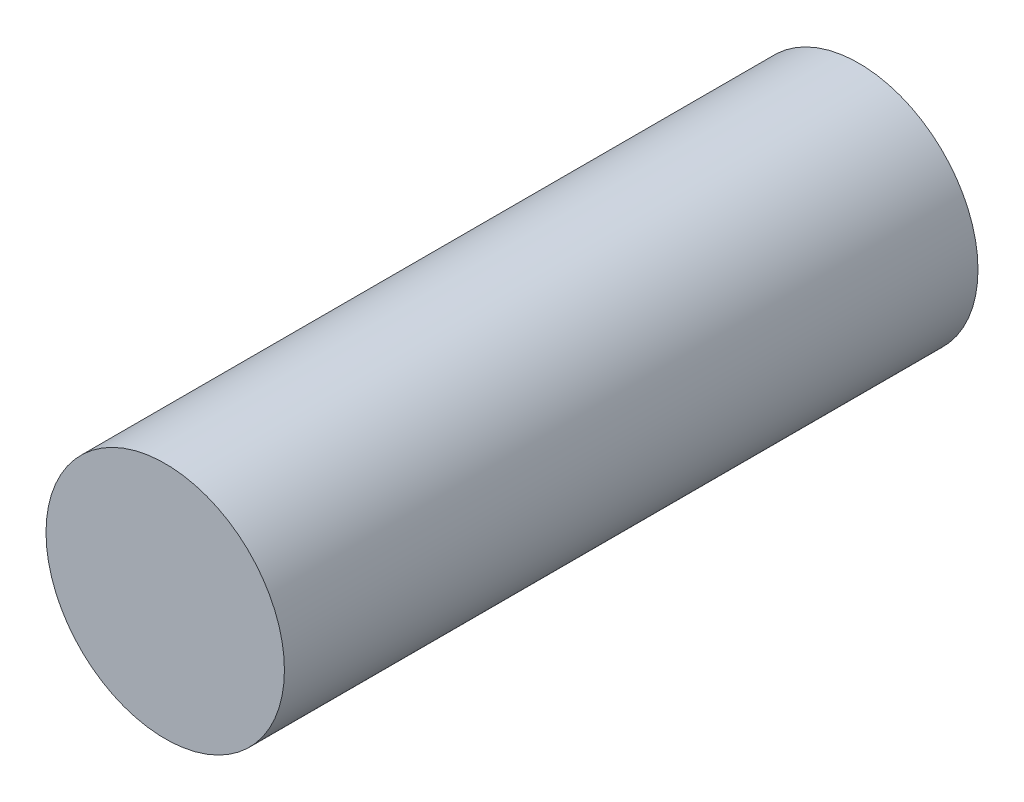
ISO-10303-21;
HEADER;
FILE_DESCRIPTION(('STEP AP214'),'2;1');
FILE_NAME('part.step','',(''),(''),'','','');
FILE_SCHEMA(('AUTOMOTIVE_DESIGN { 1 0 10303 214 1 1 1 1 }'));
ENDSEC;
DATA;
#1=APPLICATION_CONTEXT('core data for automotive mechanical design processes');
#2=APPLICATION_PROTOCOL_DEFINITION('international standard','automotive_design',2000,#1);
#3=PRODUCT_CONTEXT('',#1,'mechanical');
#4=PRODUCT('Part','Part','',(#3));
#5=PRODUCT_RELATED_PRODUCT_CATEGORY('part','',(#4));
#6=PRODUCT_DEFINITION_FORMATION('','',#4);
#7=PRODUCT_DEFINITION_CONTEXT('part definition',#1,'design');
#8=PRODUCT_DEFINITION('design','',#6,#7);
#9=PRODUCT_DEFINITION_SHAPE('','',#8);
#10=(LENGTH_UNIT() NAMED_UNIT(*) SI_UNIT(.MILLI.,.METRE.));
#11=(NAMED_UNIT(*) PLANE_ANGLE_UNIT() SI_UNIT($,.RADIAN.));
#12=(NAMED_UNIT(*) SI_UNIT($,.STERADIAN.) SOLID_ANGLE_UNIT());
#13=UNCERTAINTY_MEASURE_WITH_UNIT(LENGTH_MEASURE(1.E-05),#10,'distance_accuracy_value','');
#14=(GEOMETRIC_REPRESENTATION_CONTEXT(3) GLOBAL_UNCERTAINTY_ASSIGNED_CONTEXT((#13)) GLOBAL_UNIT_ASSIGNED_CONTEXT((#10,
#11,#12)) REPRESENTATION_CONTEXT('',''));
#15=CARTESIAN_POINT('',(0.,0.,0.));
#16=DIRECTION('',(0.,0.,1.));
#17=DIRECTION('',(1.,0.,0.));
#18=AXIS2_PLACEMENT_3D('',#15,#16,#17);
#19=CARTESIAN_POINT('',(0.,0.,160.));
#20=DIRECTION('',(0.,0.,-1.));
#21=DIRECTION('',(-1.,0.,0.));
#22=AXIS2_PLACEMENT_3D('',#19,#20,#21);
#23=CYLINDRICAL_SURFACE('',#22,27.5);
#24=CARTESIAN_POINT('',(0.,0.,160.));
#25=DIRECTION('',(0.,0.,1.));
#26=DIRECTION('',(1.,0.,0.));
#27=AXIS2_PLACEMENT_3D('',#24,#25,#26);
#28=CIRCLE('',#27,27.5);
#29=CARTESIAN_POINT('',(27.5,0.,160.));
#30=VERTEX_POINT('',#29);
#31=EDGE_CURVE('E10',#30,#30,#28,.T.);
#32=ORIENTED_EDGE('',*,*,#31,.F.);
#33=EDGE_LOOP('',(#32));
#34=FACE_BOUND('',#33,.T.);
#35=CARTESIAN_POINT('',(0.,0.,0.));
#36=DIRECTION('',(0.,0.,1.));
#37=DIRECTION('',(1.,0.,0.));
#38=AXIS2_PLACEMENT_3D('',#35,#36,#37);
#39=CIRCLE('',#38,27.5);
#40=CARTESIAN_POINT('',(27.5,0.,0.));
#41=VERTEX_POINT('',#40);
#42=EDGE_CURVE('E36',#41,#41,#39,.T.);
#43=ORIENTED_EDGE('',*,*,#42,.T.);
#44=EDGE_LOOP('',(#43));
#45=FACE_BOUND('',#44,.T.);
#46=ADVANCED_FACE('F33',(#34,#45),#23,.T.);
#47=CARTESIAN_POINT('',(0.,0.,160.));
#48=DIRECTION('',(0.,0.,1.));
#49=DIRECTION('',(1.,0.,0.));
#50=AXIS2_PLACEMENT_3D('',#47,#48,#49);
#51=PLANE('',#50);
#52=ORIENTED_EDGE('',*,*,#31,.T.);
#53=EDGE_LOOP('',(#52));
#54=FACE_BOUND('',#53,.T.);
#55=ADVANCED_FACE('F48',(#54),#51,.T.);
#56=CARTESIAN_POINT('',(0.,0.,0.));
#57=DIRECTION('',(0.,0.,1.));
#58=DIRECTION('',(1.,0.,0.));
#59=AXIS2_PLACEMENT_3D('',#56,#57,#58);
#60=PLANE('',#59);
#61=ORIENTED_EDGE('',*,*,#42,.F.);
#62=EDGE_LOOP('',(#61));
#63=FACE_BOUND('',#62,.T.);
#64=ADVANCED_FACE('F46',(#63),#60,.F.);
#65=CLOSED_SHELL('',(#46,#55,#64));
#66=MANIFOLD_SOLID_BREP('B2',#65);
#67=ADVANCED_BREP_SHAPE_REPRESENTATION('',(#18,#66),#14);
#68=SHAPE_DEFINITION_REPRESENTATION(#9,#67);
ENDSEC;
END-ISO-10303-21;
